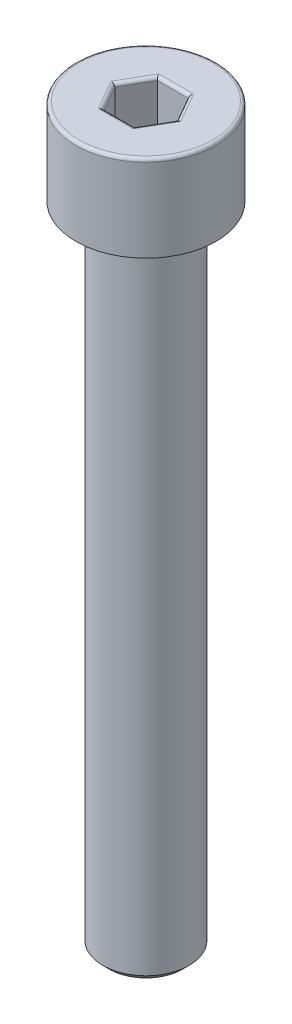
ISO-10303-21;
HEADER;
FILE_DESCRIPTION(('STEP AP214'),'2;1');
FILE_NAME('part.step','',(''),(''),'','','');
FILE_SCHEMA(('AUTOMOTIVE_DESIGN { 1 0 10303 214 1 1 1 1 }'));
ENDSEC;
DATA;
#1=APPLICATION_CONTEXT('core data for automotive mechanical design processes');
#2=APPLICATION_PROTOCOL_DEFINITION('international standard','automotive_design',2000,#1);
#3=PRODUCT_CONTEXT('',#1,'mechanical');
#4=PRODUCT('Part','Part','',(#3));
#5=PRODUCT_RELATED_PRODUCT_CATEGORY('part','',(#4));
#6=PRODUCT_DEFINITION_FORMATION('','',#4);
#7=PRODUCT_DEFINITION_CONTEXT('part definition',#1,'design');
#8=PRODUCT_DEFINITION('design','',#6,#7);
#9=PRODUCT_DEFINITION_SHAPE('','',#8);
#10=(LENGTH_UNIT() NAMED_UNIT(*) SI_UNIT(.MILLI.,.METRE.));
#11=(NAMED_UNIT(*) PLANE_ANGLE_UNIT() SI_UNIT($,.RADIAN.));
#12=(NAMED_UNIT(*) SI_UNIT($,.STERADIAN.) SOLID_ANGLE_UNIT());
#13=UNCERTAINTY_MEASURE_WITH_UNIT(LENGTH_MEASURE(1.E-05),#10,'distance_accuracy_value','');
#14=(GEOMETRIC_REPRESENTATION_CONTEXT(3) GLOBAL_UNCERTAINTY_ASSIGNED_CONTEXT((#13)) GLOBAL_UNIT_ASSIGNED_CONTEXT((#10,
#11,#12)) REPRESENTATION_CONTEXT('',''));
#15=CARTESIAN_POINT('',(0.,0.,0.));
#16=DIRECTION('',(0.,0.,1.));
#17=DIRECTION('',(1.,0.,0.));
#18=AXIS2_PLACEMENT_3D('',#15,#16,#17);
#19=CARTESIAN_POINT('',(1.52129228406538,51.4588839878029,0.));
#20=DIRECTION('',(0.,1.,0.));
#21=DIRECTION('',(0.,0.,1.));
#22=AXIS2_PLACEMENT_3D('',#19,#20,#21);
#23=PLANE('',#22);
#24=DIRECTION('',(0.5,0.,-0.866025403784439));
#25=VECTOR('',#24,1.);
#26=CARTESIAN_POINT('',(2.96466795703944,51.4588839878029,2.5));
#27=LINE('',#26,#25);
#28=CARTESIAN_POINT('',(2.96466795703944,51.4588839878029,2.5));
#29=VERTEX_POINT('',#28);
#30=CARTESIAN_POINT('',(4.40804363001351,51.4588839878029,0.));
#31=VERTEX_POINT('',#30);
#32=EDGE_CURVE('E141',#29,#31,#27,.T.);
#33=ORIENTED_EDGE('',*,*,#32,.T.);
#34=DIRECTION('',(-0.5,0.,-0.866025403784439));
#35=VECTOR('',#34,1.);
#36=CARTESIAN_POINT('',(4.40804363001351,51.4588839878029,0.));
#37=LINE('',#36,#35);
#38=CARTESIAN_POINT('',(2.96466795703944,51.4588839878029,-2.5));
#39=VERTEX_POINT('',#38);
#40=EDGE_CURVE('E147',#31,#39,#37,.T.);
#41=ORIENTED_EDGE('',*,*,#40,.T.);
#42=DIRECTION('',(-1.,0.,0.));
#43=VECTOR('',#42,1.);
#44=CARTESIAN_POINT('',(2.96466795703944,51.4588839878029,-2.5));
#45=LINE('',#44,#43);
#46=CARTESIAN_POINT('',(0.0779166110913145,51.4588839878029,-2.5));
#47=VERTEX_POINT('',#46);
#48=EDGE_CURVE('E158',#39,#47,#45,.T.);
#49=ORIENTED_EDGE('',*,*,#48,.T.);
#50=DIRECTION('',(-0.5,0.,0.866025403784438));
#51=VECTOR('',#50,1.);
#52=CARTESIAN_POINT('',(0.0779166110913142,51.4588839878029,-2.5));
#53=LINE('',#52,#51);
#54=CARTESIAN_POINT('',(-1.36545906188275,51.4588839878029,0.));
#55=VERTEX_POINT('',#54);
#56=EDGE_CURVE('E121',#47,#55,#53,.T.);
#57=ORIENTED_EDGE('',*,*,#56,.T.);
#58=DIRECTION('',(0.5,0.,0.866025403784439));
#59=VECTOR('',#58,1.);
#60=CARTESIAN_POINT('',(-1.36545906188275,51.4588839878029,0.));
#61=LINE('',#60,#59);
#62=CARTESIAN_POINT('',(0.0779166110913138,51.4588839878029,2.5));
#63=VERTEX_POINT('',#62);
#64=EDGE_CURVE('E131',#55,#63,#61,.T.);
#65=ORIENTED_EDGE('',*,*,#64,.T.);
#66=DIRECTION('',(1.,0.,0.));
#67=VECTOR('',#66,1.);
#68=CARTESIAN_POINT('',(0.077916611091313,51.4588839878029,2.5));
#69=LINE('',#68,#67);
#70=EDGE_CURVE('E136',#63,#29,#69,.T.);
#71=ORIENTED_EDGE('',*,*,#70,.T.);
#72=EDGE_LOOP('',(#33,#41,#49,#57,#65,#71));
#73=FACE_BOUND('',#72,.T.);
#74=ADVANCED_FACE('F17',(#73),#23,.T.);
#75=CARTESIAN_POINT('',(2.96466795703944,55.9588839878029,-2.5));
#76=DIRECTION('',(0.,0.,-1.));
#77=DIRECTION('',(-1.,0.,0.));
#78=AXIS2_PLACEMENT_3D('',#75,#76,#77);
#79=PLANE('',#78);
#80=DIRECTION('',(0.,1.,0.));
#81=VECTOR('',#80,1.);
#82=CARTESIAN_POINT('',(0.077916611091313,55.9588839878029,-2.5));
#83=LINE('',#82,#81);
#84=CARTESIAN_POINT('',(0.077916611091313,55.6588839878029,-2.5));
#85=VERTEX_POINT('',#84);
#86=EDGE_CURVE('E124',#85,#47,#83,.F.);
#87=ORIENTED_EDGE('',*,*,#86,.T.);
#88=ORIENTED_EDGE('',*,*,#48,.F.);
#89=DIRECTION('',(0.,1.,0.));
#90=VECTOR('',#89,1.);
#91=CARTESIAN_POINT('',(2.96466795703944,55.9588839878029,-2.5));
#92=LINE('',#91,#90);
#93=CARTESIAN_POINT('',(2.96466795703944,55.6588839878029,-2.5));
#94=VERTEX_POINT('',#93);
#95=EDGE_CURVE('E144',#39,#94,#92,.T.);
#96=ORIENTED_EDGE('',*,*,#95,.T.);
#97=DIRECTION('',(1.,0.,0.));
#98=VECTOR('',#97,1.);
#99=CARTESIAN_POINT('',(0.692980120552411,55.6588839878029,-2.5));
#100=LINE('',#99,#98);
#101=EDGE_CURVE('E77',#85,#94,#100,.T.);
#102=ORIENTED_EDGE('',*,*,#101,.F.);
#103=EDGE_LOOP('',(#87,#88,#96,#102));
#104=FACE_BOUND('',#103,.T.);
#105=ADVANCED_FACE('F373',(#104),#79,.F.);
#106=CARTESIAN_POINT('',(4.40804363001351,55.9588839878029,0.));
#107=DIRECTION('',(0.866025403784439,0.,-0.5));
#108=DIRECTION('',(-0.5,0.,-0.866025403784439));
#109=AXIS2_PLACEMENT_3D('',#106,#107,#108);
#110=PLANE('',#109);
#111=ORIENTED_EDGE('',*,*,#95,.F.);
#112=ORIENTED_EDGE('',*,*,#40,.F.);
#113=DIRECTION('',(0.,1.,0.));
#114=VECTOR('',#113,1.);
#115=CARTESIAN_POINT('',(4.40804363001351,55.9588839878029,0.));
#116=LINE('',#115,#114);
#117=CARTESIAN_POINT('',(4.40804363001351,55.6588839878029,0.));
#118=VERTEX_POINT('',#117);
#119=EDGE_CURVE('E139',#31,#118,#116,.T.);
#120=ORIENTED_EDGE('',*,*,#119,.T.);
#121=DIRECTION('',(0.5,0.,0.866025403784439));
#122=VECTOR('',#121,1.);
#123=CARTESIAN_POINT('',(3.65969971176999,55.6588839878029,-1.29616968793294));
#124=LINE('',#123,#122);
#125=EDGE_CURVE('E81',#94,#118,#124,.T.);
#126=ORIENTED_EDGE('',*,*,#125,.F.);
#127=EDGE_LOOP('',(#111,#112,#120,#126));
#128=FACE_BOUND('',#127,.T.);
#129=ADVANCED_FACE('F365',(#128),#110,.F.);
#130=CARTESIAN_POINT('',(2.96466795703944,55.9588839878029,2.5));
#131=DIRECTION('',(0.866025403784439,0.,0.5));
#132=DIRECTION('',(0.5,0.,-0.866025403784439));
#133=AXIS2_PLACEMENT_3D('',#130,#131,#132);
#134=PLANE('',#133);
#135=ORIENTED_EDGE('',*,*,#119,.F.);
#136=ORIENTED_EDGE('',*,*,#32,.F.);
#137=DIRECTION('',(0.,1.,0.));
#138=VECTOR('',#137,1.);
#139=CARTESIAN_POINT('',(2.96466795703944,55.9588839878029,2.5));
#140=LINE('',#139,#138);
#141=CARTESIAN_POINT('',(2.96466795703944,55.6588839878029,2.5));
#142=VERTEX_POINT('',#141);
#143=EDGE_CURVE('E134',#29,#142,#140,.T.);
#144=ORIENTED_EDGE('',*,*,#143,.T.);
#145=DIRECTION('',(-0.5,0.,0.866025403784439));
#146=VECTOR('',#145,1.);
#147=CARTESIAN_POINT('',(2.93801187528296,55.6588839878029,2.54616968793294));
#148=LINE('',#147,#146);
#149=EDGE_CURVE('E80',#118,#142,#148,.T.);
#150=ORIENTED_EDGE('',*,*,#149,.F.);
#151=EDGE_LOOP('',(#135,#136,#144,#150));
#152=FACE_BOUND('',#151,.T.);
#153=ADVANCED_FACE('F357',(#152),#134,.F.);
#154=CARTESIAN_POINT('',(0.077916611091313,55.9588839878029,2.5));
#155=DIRECTION('',(0.,0.,1.));
#156=DIRECTION('',(1.,0.,0.));
#157=AXIS2_PLACEMENT_3D('',#154,#155,#156);
#158=PLANE('',#157);
#159=ORIENTED_EDGE('',*,*,#143,.F.);
#160=ORIENTED_EDGE('',*,*,#70,.F.);
#161=DIRECTION('',(0.,1.,0.));
#162=VECTOR('',#161,1.);
#163=CARTESIAN_POINT('',(0.0779166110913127,55.9588839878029,2.5));
#164=LINE('',#163,#162);
#165=CARTESIAN_POINT('',(0.0779166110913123,55.6588839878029,2.5));
#166=VERTEX_POINT('',#165);
#167=EDGE_CURVE('E127',#63,#166,#164,.T.);
#168=ORIENTED_EDGE('',*,*,#167,.T.);
#169=DIRECTION('',(-1.,0.,0.));
#170=VECTOR('',#169,1.);
#171=CARTESIAN_POINT('',(-0.750395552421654,55.6588839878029,2.5));
#172=LINE('',#171,#170);
#173=EDGE_CURVE('E111',#142,#166,#172,.T.);
#174=ORIENTED_EDGE('',*,*,#173,.F.);
#175=EDGE_LOOP('',(#159,#160,#168,#174));
#176=FACE_BOUND('',#175,.T.);
#177=ADVANCED_FACE('F349',(#176),#158,.F.);
#178=CARTESIAN_POINT('',(-1.36545906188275,55.9588839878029,0.));
#179=DIRECTION('',(-0.866025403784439,0.,0.5));
#180=DIRECTION('',(0.5,0.,0.866025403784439));
#181=AXIS2_PLACEMENT_3D('',#178,#179,#180);
#182=PLANE('',#181);
#183=ORIENTED_EDGE('',*,*,#167,.F.);
#184=ORIENTED_EDGE('',*,*,#64,.F.);
#185=DIRECTION('',(0.,1.,0.));
#186=VECTOR('',#185,1.);
#187=CARTESIAN_POINT('',(-1.36545906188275,55.9588839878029,0.));
#188=LINE('',#187,#186);
#189=CARTESIAN_POINT('',(-1.36545906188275,55.6588839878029,0.));
#190=VERTEX_POINT('',#189);
#191=EDGE_CURVE('E119',#55,#190,#188,.T.);
#192=ORIENTED_EDGE('',*,*,#191,.T.);
#193=DIRECTION('',(-0.5,0.,-0.866025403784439));
#194=VECTOR('',#193,1.);
#195=CARTESIAN_POINT('',(-1.39211514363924,55.6588839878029,-0.046169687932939));
#196=LINE('',#195,#194);
#197=EDGE_CURVE('E103',#166,#190,#196,.T.);
#198=ORIENTED_EDGE('',*,*,#197,.F.);
#199=EDGE_LOOP('',(#183,#184,#192,#198));
#200=FACE_BOUND('',#199,.T.);
#201=ADVANCED_FACE('F341',(#200),#182,.F.);
#202=CARTESIAN_POINT('',(0.077916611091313,55.9588839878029,-2.5));
#203=DIRECTION('',(-0.866025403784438,0.,-0.5));
#204=DIRECTION('',(-0.5,0.,0.866025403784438));
#205=AXIS2_PLACEMENT_3D('',#202,#203,#204);
#206=PLANE('',#205);
#207=ORIENTED_EDGE('',*,*,#191,.F.);
#208=ORIENTED_EDGE('',*,*,#56,.F.);
#209=ORIENTED_EDGE('',*,*,#86,.F.);
#210=DIRECTION('',(0.5,0.,-0.866025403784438));
#211=VECTOR('',#210,1.);
#212=CARTESIAN_POINT('',(-0.670427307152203,55.6588839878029,-1.20383031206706));
#213=LINE('',#212,#211);
#214=EDGE_CURVE('E185',#190,#85,#213,.T.);
#215=ORIENTED_EDGE('',*,*,#214,.F.);
#216=EDGE_LOOP('',(#207,#208,#209,#215));
#217=FACE_BOUND('',#216,.T.);
#218=ADVANCED_FACE('F334',(#217),#206,.F.);
#219=CARTESIAN_POINT('',(0.692980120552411,55.6588839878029,-2.8));
#220=DIRECTION('',(1.,0.,0.));
#221=DIRECTION('',(0.,1.,0.));
#222=AXIS2_PLACEMENT_3D('',#219,#220,#221);
#223=CYLINDRICAL_SURFACE('',#222,0.3);
#224=DIRECTION('',(1.,0.,0.));
#225=VECTOR('',#224,1.);
#226=CARTESIAN_POINT('',(-1.57870771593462,55.9588839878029,-2.8));
#227=LINE('',#226,#225);
#228=CARTESIAN_POINT('',(-0.0952884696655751,55.9588839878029,-2.8));
#229=VERTEX_POINT('',#228);
#230=CARTESIAN_POINT('',(3.13787303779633,55.9588839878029,-2.8));
#231=VERTEX_POINT('',#230);
#232=EDGE_CURVE('E75',#229,#231,#227,.T.);
#233=ORIENTED_EDGE('',*,*,#232,.F.);
#234=CARTESIAN_POINT('',(-0.0952884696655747,55.6588839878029,-2.8));
#235=DIRECTION('',(0.866025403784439,0.,-0.5));
#236=DIRECTION('',(0.5,0.,0.866025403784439));
#237=AXIS2_PLACEMENT_3D('',#234,#235,#236);
#238=ELLIPSE('',#237,0.346410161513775,0.3);
#239=EDGE_CURVE('E98',#85,#229,#238,.F.);
#240=ORIENTED_EDGE('',*,*,#239,.F.);
#241=ORIENTED_EDGE('',*,*,#101,.T.);
#242=CARTESIAN_POINT('',(3.13787303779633,55.6588839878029,-2.8));
#243=DIRECTION('',(0.866025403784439,0.,0.5));
#244=DIRECTION('',(-0.5,0.,0.866025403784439));
#245=AXIS2_PLACEMENT_3D('',#242,#243,#244);
#246=ELLIPSE('',#245,0.346410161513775,0.3);
#247=EDGE_CURVE('E20',#231,#94,#246,.T.);
#248=ORIENTED_EDGE('',*,*,#247,.F.);
#249=EDGE_LOOP('',(#233,#240,#241,#248));
#250=FACE_BOUND('',#249,.T.);
#251=ADVANCED_FACE('F72',(#250),#223,.T.);
#252=CARTESIAN_POINT('',(3.91950733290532,55.6588839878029,-1.44616968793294));
#253=DIRECTION('',(0.5,0.,0.866025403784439));
#254=DIRECTION('',(0.866025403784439,0.,-0.5));
#255=AXIS2_PLACEMENT_3D('',#252,#253,#254);
#256=CYLINDRICAL_SURFACE('',#255,0.3);
#257=DIRECTION('',(0.5,0.,0.866025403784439));
#258=VECTOR('',#257,1.);
#259=CARTESIAN_POINT('',(3.13787303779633,55.9588839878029,-2.8));
#260=LINE('',#259,#258);
#261=CARTESIAN_POINT('',(4.75445379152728,55.9588839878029,0.));
#262=VERTEX_POINT('',#261);
#263=EDGE_CURVE('E83',#231,#262,#260,.T.);
#264=ORIENTED_EDGE('',*,*,#263,.F.);
#265=ORIENTED_EDGE('',*,*,#247,.T.);
#266=ORIENTED_EDGE('',*,*,#125,.T.);
#267=CARTESIAN_POINT('',(4.75445379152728,55.6588839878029,0.));
#268=DIRECTION('',(0.,0.,1.));
#269=DIRECTION('',(1.,0.,0.));
#270=AXIS2_PLACEMENT_3D('',#267,#268,#269);
#271=ELLIPSE('',#270,0.346410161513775,0.3);
#272=EDGE_CURVE('E86',#262,#118,#271,.T.);
#273=ORIENTED_EDGE('',*,*,#272,.F.);
#274=EDGE_LOOP('',(#264,#265,#266,#273));
#275=FACE_BOUND('',#274,.T.);
#276=ADVANCED_FACE('F84',(#275),#256,.T.);
#277=CARTESIAN_POINT('',(3.19781949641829,55.6588839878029,2.69616968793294));
#278=DIRECTION('',(-0.5,0.,0.866025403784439));
#279=DIRECTION('',(0.866025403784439,0.,0.5));
#280=AXIS2_PLACEMENT_3D('',#277,#278,#279);
#281=CYLINDRICAL_SURFACE('',#280,0.3);
#282=DIRECTION('',(-0.5,0.,0.866025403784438));
#283=VECTOR('',#282,1.);
#284=CARTESIAN_POINT('',(4.75445379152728,55.9588839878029,0.));
#285=LINE('',#284,#283);
#286=CARTESIAN_POINT('',(3.13787303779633,55.9588839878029,2.8));
#287=VERTEX_POINT('',#286);
#288=EDGE_CURVE('E90',#262,#287,#285,.T.);
#289=ORIENTED_EDGE('',*,*,#288,.F.);
#290=ORIENTED_EDGE('',*,*,#272,.T.);
#291=ORIENTED_EDGE('',*,*,#149,.T.);
#292=CARTESIAN_POINT('',(3.13787303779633,55.6588839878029,2.8));
#293=DIRECTION('',(-0.866025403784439,0.,0.5));
#294=DIRECTION('',(-0.5,0.,-0.866025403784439));
#295=AXIS2_PLACEMENT_3D('',#292,#293,#294);
#296=ELLIPSE('',#295,0.346410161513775,0.3);
#297=EDGE_CURVE('E106',#287,#142,#296,.T.);
#298=ORIENTED_EDGE('',*,*,#297,.F.);
#299=EDGE_LOOP('',(#289,#290,#291,#298));
#300=FACE_BOUND('',#299,.T.);
#301=ADVANCED_FACE('F190',(#300),#281,.T.);
#302=CARTESIAN_POINT('',(-0.750395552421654,55.6588839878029,2.8));
#303=DIRECTION('',(-1.,0.,0.));
#304=DIRECTION('',(0.,-1.,0.));
#305=AXIS2_PLACEMENT_3D('',#302,#303,#304);
#306=CYLINDRICAL_SURFACE('',#305,0.3);
#307=DIRECTION('',(1.,0.,0.));
#308=VECTOR('',#307,1.);
#309=CARTESIAN_POINT('',(-1.57870771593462,55.9588839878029,2.8));
#310=LINE('',#309,#308);
#311=CARTESIAN_POINT('',(-0.0952884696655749,55.9588839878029,2.8));
#312=VERTEX_POINT('',#311);
#313=EDGE_CURVE('E107',#287,#312,#310,.F.);
#314=ORIENTED_EDGE('',*,*,#313,.F.);
#315=ORIENTED_EDGE('',*,*,#297,.T.);
#316=ORIENTED_EDGE('',*,*,#173,.T.);
#317=CARTESIAN_POINT('',(-0.0952884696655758,55.6588839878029,2.8));
#318=DIRECTION('',(-0.866025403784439,0.,-0.5));
#319=DIRECTION('',(0.5,0.,-0.866025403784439));
#320=AXIS2_PLACEMENT_3D('',#317,#318,#319);
#321=ELLIPSE('',#320,0.346410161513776,0.3);
#322=EDGE_CURVE('E105',#312,#166,#321,.T.);
#323=ORIENTED_EDGE('',*,*,#322,.F.);
#324=EDGE_LOOP('',(#314,#315,#316,#323));
#325=FACE_BOUND('',#324,.T.);
#326=ADVANCED_FACE('F194',(#325),#306,.T.);
#327=CARTESIAN_POINT('',(-1.65192276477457,55.6588839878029,0.103830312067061));
#328=DIRECTION('',(-0.5,0.,-0.866025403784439));
#329=DIRECTION('',(-0.866025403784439,0.,0.5));
#330=AXIS2_PLACEMENT_3D('',#327,#328,#329);
#331=CYLINDRICAL_SURFACE('',#330,0.3);
#332=DIRECTION('',(-0.5,0.,-0.866025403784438));
#333=VECTOR('',#332,1.);
#334=CARTESIAN_POINT('',(-0.095288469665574,55.9588839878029,2.8));
#335=LINE('',#334,#333);
#336=CARTESIAN_POINT('',(-1.71186922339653,55.9588839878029,0.));
#337=VERTEX_POINT('',#336);
#338=EDGE_CURVE('E110',#312,#337,#335,.T.);
#339=ORIENTED_EDGE('',*,*,#338,.F.);
#340=ORIENTED_EDGE('',*,*,#322,.T.);
#341=ORIENTED_EDGE('',*,*,#197,.T.);
#342=CARTESIAN_POINT('',(-1.71186922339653,55.6588839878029,0.));
#343=DIRECTION('',(0.,0.,-1.));
#344=DIRECTION('',(-1.,0.,0.));
#345=AXIS2_PLACEMENT_3D('',#342,#343,#344);
#346=ELLIPSE('',#345,0.346410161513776,0.3);
#347=EDGE_CURVE('E35',#337,#190,#346,.T.);
#348=ORIENTED_EDGE('',*,*,#347,.F.);
#349=EDGE_LOOP('',(#339,#340,#341,#348));
#350=FACE_BOUND('',#349,.T.);
#351=ADVANCED_FACE('F196',(#350),#331,.T.);
#352=CARTESIAN_POINT('',(-0.930234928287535,55.6588839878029,-1.35383031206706));
#353=DIRECTION('',(0.5,0.,-0.866025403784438));
#354=DIRECTION('',(-0.866025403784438,0.,-0.5));
#355=AXIS2_PLACEMENT_3D('',#352,#353,#354);
#356=CYLINDRICAL_SURFACE('',#355,0.3);
#357=DIRECTION('',(0.5,0.,-0.866025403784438));
#358=VECTOR('',#357,1.);
#359=CARTESIAN_POINT('',(-1.71186922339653,55.9588839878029,0.));
#360=LINE('',#359,#358);
#361=EDGE_CURVE('E96',#337,#229,#360,.T.);
#362=ORIENTED_EDGE('',*,*,#361,.F.);
#363=ORIENTED_EDGE('',*,*,#347,.T.);
#364=ORIENTED_EDGE('',*,*,#214,.T.);
#365=ORIENTED_EDGE('',*,*,#239,.T.);
#366=EDGE_LOOP('',(#362,#363,#364,#365));
#367=FACE_BOUND('',#366,.T.);
#368=ADVANCED_FACE('F298',(#367),#356,.T.);
#369=CARTESIAN_POINT('',(-1.57870771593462,55.9588839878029,0.));
#370=DIRECTION('',(0.,1.,0.));
#371=DIRECTION('',(0.,0.,1.));
#372=AXIS2_PLACEMENT_3D('',#369,#370,#371);
#373=PLANE('',#372);
#374=ORIENTED_EDGE('',*,*,#338,.T.);
#375=ORIENTED_EDGE('',*,*,#361,.T.);
#376=ORIENTED_EDGE('',*,*,#232,.T.);
#377=ORIENTED_EDGE('',*,*,#263,.T.);
#378=ORIENTED_EDGE('',*,*,#288,.T.);
#379=ORIENTED_EDGE('',*,*,#313,.T.);
#380=EDGE_LOOP('',(#374,#375,#376,#377,#378,#379));
#381=FACE_BOUND('',#380,.T.);
#382=CARTESIAN_POINT('',(1.52129228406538,55.9588839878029,0.));
#383=DIRECTION('',(0.,-1.,0.));
#384=DIRECTION('',(-1.,0.,0.));
#385=AXIS2_PLACEMENT_3D('',#382,#383,#384);
#386=CIRCLE('',#385,6.19999999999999);
#387=CARTESIAN_POINT('',(-4.67870771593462,55.9588839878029,0.));
#388=VERTEX_POINT('',#387);
#389=EDGE_CURVE('E197',#388,#388,#386,.T.);
#390=ORIENTED_EDGE('',*,*,#389,.F.);
#391=EDGE_LOOP('',(#390));
#392=FACE_BOUND('',#391,.T.);
#393=ADVANCED_FACE('F94',(#381,#392),#373,.T.);
#394=CARTESIAN_POINT('',(1.52129228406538,55.6588839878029,0.));
#395=DIRECTION('',(0.,1.,0.));
#396=DIRECTION('',(0.,0.,1.));
#397=AXIS2_PLACEMENT_3D('',#394,#395,#396);
#398=TOROIDAL_SURFACE('',#397,6.19999999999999,0.300000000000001);
#399=CARTESIAN_POINT('',(1.52129228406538,55.6588839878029,0.));
#400=DIRECTION('',(0.,1.,0.));
#401=DIRECTION('',(-1.,0.,0.));
#402=AXIS2_PLACEMENT_3D('',#399,#400,#401);
#403=CIRCLE('',#402,6.49999999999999);
#404=CARTESIAN_POINT('',(-4.97870771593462,55.6588839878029,0.));
#405=VERTEX_POINT('',#404);
#406=EDGE_CURVE('E182',#405,#405,#403,.F.);
#407=ORIENTED_EDGE('',*,*,#406,.F.);
#408=EDGE_LOOP('',(#407));
#409=FACE_BOUND('',#408,.T.);
#410=ORIENTED_EDGE('',*,*,#389,.T.);
#411=EDGE_LOOP('',(#410));
#412=FACE_BOUND('',#411,.T.);
#413=ADVANCED_FACE('F207',(#409,#412),#398,.T.);
#414=CARTESIAN_POINT('',(1.52129228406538,51.8088839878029,0.));
#415=DIRECTION('',(0.,1.,0.));
#416=DIRECTION('',(-1.,0.,0.));
#417=AXIS2_PLACEMENT_3D('',#414,#415,#416);
#418=CYLINDRICAL_SURFACE('',#417,6.49999999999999);
#419=CARTESIAN_POINT('',(1.52129228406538,47.9588839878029,0.));
#420=DIRECTION('',(0.,1.,0.));
#421=DIRECTION('',(-1.,0.,0.));
#422=AXIS2_PLACEMENT_3D('',#419,#420,#421);
#423=CIRCLE('',#422,6.49999999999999);
#424=CARTESIAN_POINT('',(-4.97870771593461,47.9588839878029,0.));
#425=VERTEX_POINT('',#424);
#426=EDGE_CURVE('E180',#425,#425,#423,.F.);
#427=ORIENTED_EDGE('',*,*,#426,.F.);
#428=EDGE_LOOP('',(#427));
#429=FACE_BOUND('',#428,.T.);
#430=ORIENTED_EDGE('',*,*,#406,.T.);
#431=EDGE_LOOP('',(#430));
#432=FACE_BOUND('',#431,.T.);
#433=ADVANCED_FACE('F218',(#429,#432),#418,.T.);
#434=CARTESIAN_POINT('',(-0.178707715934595,-12.0411160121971,0.));
#435=DIRECTION('',(0.,-1.,0.));
#436=DIRECTION('',(0.,0.,-1.));
#437=AXIS2_PLACEMENT_3D('',#434,#435,#436);
#438=PLANE('',#437);
#439=CARTESIAN_POINT('',(1.52129228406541,-12.0411160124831,0.));
#440=DIRECTION('',(0.,1.,0.));
#441=DIRECTION('',(-1.,0.,0.));
#442=AXIS2_PLACEMENT_3D('',#439,#440,#441);
#443=CIRCLE('',#442,3.40000000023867);
#444=CARTESIAN_POINT('',(-1.87870771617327,-12.0411160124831,0.));
#445=VERTEX_POINT('',#444);
#446=EDGE_CURVE('E177',#445,#445,#443,.T.);
#447=ORIENTED_EDGE('',*,*,#446,.F.);
#448=EDGE_LOOP('',(#447));
#449=FACE_BOUND('',#448,.T.);
#450=ADVANCED_FACE('F243',(#449),#438,.T.);
#451=CARTESIAN_POINT('',(-3.72870771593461,47.9588839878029,0.));
#452=DIRECTION('',(0.,-1.,0.));
#453=DIRECTION('',(0.,0.,-1.));
#454=AXIS2_PLACEMENT_3D('',#451,#452,#453);
#455=PLANE('',#454);
#456=CARTESIAN_POINT('',(1.52129228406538,47.9588839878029,0.));
#457=DIRECTION('',(0.,1.,0.));
#458=DIRECTION('',(-1.,0.,0.));
#459=AXIS2_PLACEMENT_3D('',#456,#457,#458);
#460=CIRCLE('',#459,4.);
#461=CARTESIAN_POINT('',(-2.47870771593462,47.9588839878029,0.));
#462=VERTEX_POINT('',#461);
#463=EDGE_CURVE('E26',#462,#462,#460,.F.);
#464=ORIENTED_EDGE('',*,*,#463,.F.);
#465=EDGE_LOOP('',(#464));
#466=FACE_BOUND('',#465,.T.);
#467=ORIENTED_EDGE('',*,*,#426,.T.);
#468=EDGE_LOOP('',(#467));
#469=FACE_BOUND('',#468,.T.);
#470=ADVANCED_FACE('F249',(#466,#469),#455,.T.);
#471=CARTESIAN_POINT('',(1.5212922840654,-11.4411160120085,0.));
#472=DIRECTION('',(0.,1.,0.));
#473=DIRECTION('',(-1.,0.,0.));
#474=AXIS2_PLACEMENT_3D('',#471,#472,#473);
#475=CONICAL_SURFACE('',#474,3.99999999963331,0.785398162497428);
#476=ORIENTED_EDGE('',*,*,#446,.T.);
#477=EDGE_LOOP('',(#476));
#478=FACE_BOUND('',#477,.T.);
#479=CARTESIAN_POINT('',(1.5212922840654,-11.4411160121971,0.));
#480=DIRECTION('',(0.,1.,0.));
#481=DIRECTION('',(-1.,0.,0.));
#482=AXIS2_PLACEMENT_3D('',#479,#480,#481);
#483=CIRCLE('',#482,4.);
#484=CARTESIAN_POINT('',(-2.47870771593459,-11.4411160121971,0.));
#485=VERTEX_POINT('',#484);
#486=EDGE_CURVE('E11',#485,#485,#483,.T.);
#487=ORIENTED_EDGE('',*,*,#486,.F.);
#488=EDGE_LOOP('',(#487));
#489=FACE_BOUND('',#488,.T.);
#490=ADVANCED_FACE('F254',(#478,#489),#475,.T.);
#491=CARTESIAN_POINT('',(1.52129228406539,18.2588839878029,0.));
#492=DIRECTION('',(0.,1.,0.));
#493=DIRECTION('',(-1.,0.,0.));
#494=AXIS2_PLACEMENT_3D('',#491,#492,#493);
#495=CYLINDRICAL_SURFACE('',#494,4.);
#496=ORIENTED_EDGE('',*,*,#486,.T.);
#497=EDGE_LOOP('',(#496));
#498=FACE_BOUND('',#497,.T.);
#499=ORIENTED_EDGE('',*,*,#463,.T.);
#500=EDGE_LOOP('',(#499));
#501=FACE_BOUND('',#500,.T.);
#502=ADVANCED_FACE('F252',(#498,#501),#495,.T.);
#503=CLOSED_SHELL('',(#74,#105,#129,#153,#177,#201,#218,#251,#276,#301,#326,#351,#368,#393,#413,
#433,#450,#470,#490,#502));
#504=MANIFOLD_SOLID_BREP('B1',#503);
#505=ADVANCED_BREP_SHAPE_REPRESENTATION('',(#18,#504),#14);
#506=SHAPE_DEFINITION_REPRESENTATION(#9,#505);
ENDSEC;
END-ISO-10303-21;
